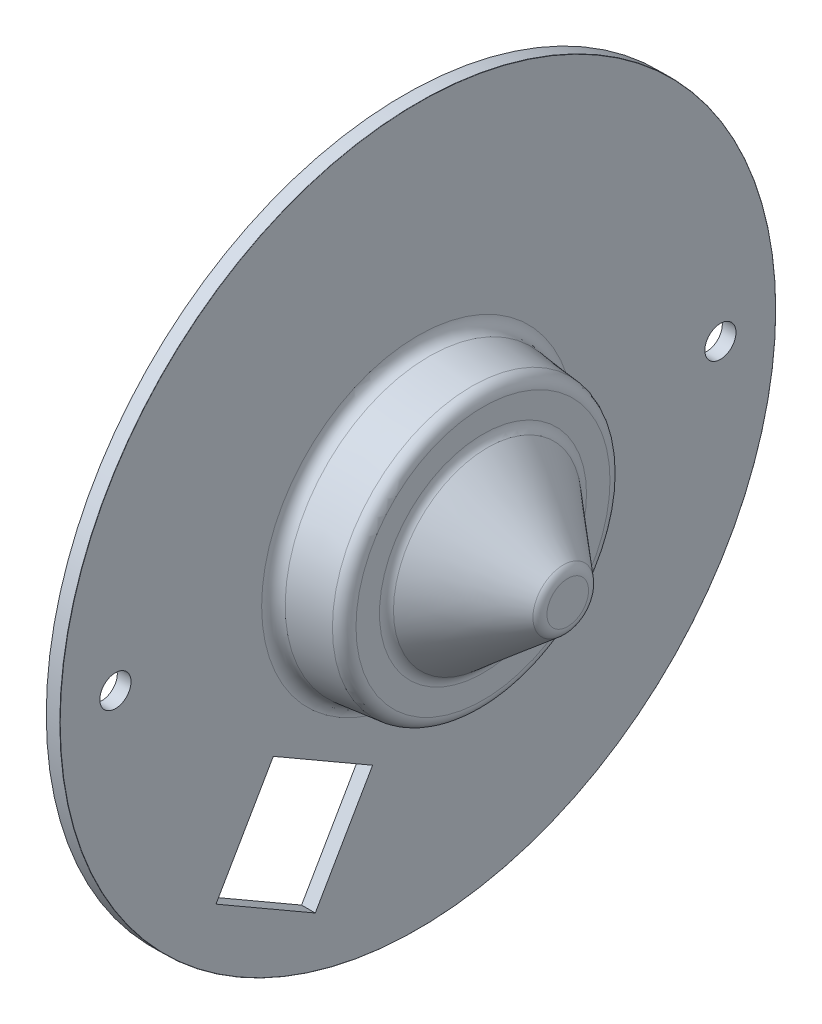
ISO-10303-21;
HEADER;
FILE_DESCRIPTION(('STEP AP214'),'2;1');
FILE_NAME('part.step','',(''),(''),'','','');
FILE_SCHEMA(('AUTOMOTIVE_DESIGN { 1 0 10303 214 1 1 1 1 }'));
ENDSEC;
DATA;
#1=APPLICATION_CONTEXT('core data for automotive mechanical design processes');
#2=APPLICATION_PROTOCOL_DEFINITION('international standard','automotive_design',2000,#1);
#3=PRODUCT_CONTEXT('',#1,'mechanical');
#4=PRODUCT('Part','Part','',(#3));
#5=PRODUCT_RELATED_PRODUCT_CATEGORY('part','',(#4));
#6=PRODUCT_DEFINITION_FORMATION('','',#4);
#7=PRODUCT_DEFINITION_CONTEXT('part definition',#1,'design');
#8=PRODUCT_DEFINITION('design','',#6,#7);
#9=PRODUCT_DEFINITION_SHAPE('','',#8);
#10=(LENGTH_UNIT() NAMED_UNIT(*) SI_UNIT(.MILLI.,.METRE.));
#11=(NAMED_UNIT(*) PLANE_ANGLE_UNIT() SI_UNIT($,.RADIAN.));
#12=(NAMED_UNIT(*) SI_UNIT($,.STERADIAN.) SOLID_ANGLE_UNIT());
#13=UNCERTAINTY_MEASURE_WITH_UNIT(LENGTH_MEASURE(1.E-05),#10,'distance_accuracy_value','');
#14=(GEOMETRIC_REPRESENTATION_CONTEXT(3) GLOBAL_UNCERTAINTY_ASSIGNED_CONTEXT((#13)) GLOBAL_UNIT_ASSIGNED_CONTEXT((#10,
#11,#12)) REPRESENTATION_CONTEXT('',''));
#15=CARTESIAN_POINT('',(0.,0.,0.));
#16=DIRECTION('',(0.,0.,1.));
#17=DIRECTION('',(1.,0.,0.));
#18=AXIS2_PLACEMENT_3D('',#15,#16,#17);
#19=CARTESIAN_POINT('',(16.6624,0.,0.));
#20=DIRECTION('',(1.,0.,0.));
#21=DIRECTION('',(0.,0.,-1.));
#22=AXIS2_PLACEMENT_3D('',#19,#20,#21);
#23=PLANE('',#22);
#24=CARTESIAN_POINT('',(16.6624,0.,0.));
#25=DIRECTION('',(-1.,0.,0.));
#26=DIRECTION('',(0.,0.,-1.));
#27=AXIS2_PLACEMENT_3D('',#24,#25,#26);
#28=CIRCLE('',#27,2.1181248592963);
#29=CARTESIAN_POINT('',(16.6624,0.,-2.1181248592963));
#30=VERTEX_POINT('',#29);
#31=EDGE_CURVE('E209',#30,#30,#28,.T.);
#32=ORIENTED_EDGE('',*,*,#31,.F.);
#33=EDGE_LOOP('',(#32));
#34=FACE_BOUND('',#33,.T.);
#35=ADVANCED_FACE('F17',(#34),#23,.T.);
#36=CARTESIAN_POINT('',(15.3924,0.,0.));
#37=DIRECTION('',(-1.,0.,0.));
#38=DIRECTION('',(0.,1.,0.));
#39=AXIS2_PLACEMENT_3D('',#36,#37,#38);
#40=TOROIDAL_SURFACE('',#39,2.1181248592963,1.27);
#41=CARTESIAN_POINT('',(16.2087402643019,0.,0.));
#42=DIRECTION('',(-1.,0.,0.));
#43=DIRECTION('',(0.,0.,-1.));
#44=AXIS2_PLACEMENT_3D('',#41,#42,#43);
#45=CIRCLE('',#44,3.09100130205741);
#46=CARTESIAN_POINT('',(16.2087402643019,0.,3.09100130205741));
#47=VERTEX_POINT('',#46);
#48=EDGE_CURVE('E201',#47,#47,#45,.T.);
#49=ORIENTED_EDGE('',*,*,#48,.F.);
#50=EDGE_LOOP('',(#49));
#51=FACE_BOUND('',#50,.T.);
#52=ORIENTED_EDGE('',*,*,#31,.T.);
#53=EDGE_LOOP('',(#52));
#54=FACE_BOUND('',#53,.T.);
#55=ADVANCED_FACE('F216',(#51,#54),#40,.T.);
#56=CARTESIAN_POINT('',(8.4800597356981,0.,0.));
#57=DIRECTION('',(-1.,0.,0.));
#58=DIRECTION('',(0.,0.,1.));
#59=AXIS2_PLACEMENT_3D('',#56,#57,#58);
#60=CONICAL_SURFACE('',#59,9.57613428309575,0.698131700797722);
#61=CARTESIAN_POINT('',(8.48005973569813,0.,0.));
#62=DIRECTION('',(-1.,0.,0.));
#63=DIRECTION('',(0.,1.,0.));
#64=AXIS2_PLACEMENT_3D('',#61,#62,#63);
#65=CIRCLE('',#64,9.57613428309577);
#66=CARTESIAN_POINT('',(8.48005973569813,0.,9.57613428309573));
#67=VERTEX_POINT('',#66);
#68=EDGE_CURVE('E187',#67,#67,#65,.F.);
#69=CARTESIAN_POINT('',(16.2087402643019,0.,3.09100130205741));
#70=CARTESIAN_POINT('',(16.1282331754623,0.,3.15855477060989));
#71=CARTESIAN_POINT('',(16.0477260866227,0.,3.22610823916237));
#72=CARTESIAN_POINT('',(15.8867119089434,0.,3.36121517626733));
#73=CARTESIAN_POINT('',(15.8062048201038,0.,3.42876864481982));
#74=CARTESIAN_POINT('',(15.6451906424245,0.,3.56387558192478));
#75=CARTESIAN_POINT('',(15.5646835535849,0.,3.63142905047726));
#76=CARTESIAN_POINT('',(15.4036693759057,0.,3.76653598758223));
#77=CARTESIAN_POINT('',(15.3231622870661,0.,3.83408945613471));
#78=CARTESIAN_POINT('',(15.1621481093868,0.,3.96919639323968));
#79=CARTESIAN_POINT('',(15.0816410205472,0.,4.03674986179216));
#80=CARTESIAN_POINT('',(14.9206268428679,0.,4.17185679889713));
#81=CARTESIAN_POINT('',(14.8401197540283,0.,4.23941026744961));
#82=CARTESIAN_POINT('',(14.6791055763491,0.,4.37451720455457));
#83=CARTESIAN_POINT('',(14.5985984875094,0.,4.44207067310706));
#84=CARTESIAN_POINT('',(14.4375843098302,0.,4.57717761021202));
#85=CARTESIAN_POINT('',(14.3570772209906,0.,4.6447310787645));
#86=CARTESIAN_POINT('',(14.1960630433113,0.,4.77983801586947));
#87=CARTESIAN_POINT('',(14.1155559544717,0.,4.84739148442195));
#88=CARTESIAN_POINT('',(13.9545417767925,0.,4.98249842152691));
#89=CARTESIAN_POINT('',(13.8740346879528,0.,5.0500518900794));
#90=CARTESIAN_POINT('',(13.7130205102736,0.,5.18515882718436));
#91=CARTESIAN_POINT('',(13.632513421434,0.,5.25271229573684));
#92=CARTESIAN_POINT('',(13.4714992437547,0.,5.38781923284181));
#93=CARTESIAN_POINT('',(13.3909921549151,0.,5.45537270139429));
#94=CARTESIAN_POINT('',(13.2299779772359,0.,5.59047963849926));
#95=CARTESIAN_POINT('',(13.1494708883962,0.,5.65803310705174));
#96=CARTESIAN_POINT('',(12.988456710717,0.,5.79314004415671));
#97=CARTESIAN_POINT('',(12.9079496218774,0.,5.86069351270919));
#98=CARTESIAN_POINT('',(12.7469354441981,0.,5.99580044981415));
#99=CARTESIAN_POINT('',(12.6664283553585,0.,6.06335391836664));
#100=CARTESIAN_POINT('',(12.5054141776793,0.,6.1984608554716));
#101=CARTESIAN_POINT('',(12.4249070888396,0.,6.26601432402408));
#102=CARTESIAN_POINT('',(12.2638929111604,0.,6.40112126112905));
#103=CARTESIAN_POINT('',(12.1833858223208,0.,6.46867472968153));
#104=CARTESIAN_POINT('',(12.0223716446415,0.,6.60378166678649));
#105=CARTESIAN_POINT('',(11.9418645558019,0.,6.67133513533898));
#106=CARTESIAN_POINT('',(11.7808503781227,0.,6.80644207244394));
#107=CARTESIAN_POINT('',(11.700343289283,0.,6.87399554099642));
#108=CARTESIAN_POINT('',(11.5393291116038,0.,7.00910247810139));
#109=CARTESIAN_POINT('',(11.4588220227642,0.,7.07665594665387));
#110=CARTESIAN_POINT('',(11.2978078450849,0.,7.21176288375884));
#111=CARTESIAN_POINT('',(11.2173007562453,0.,7.27931635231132));
#112=CARTESIAN_POINT('',(11.0562865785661,0.,7.41442328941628));
#113=CARTESIAN_POINT('',(10.9757794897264,0.,7.48197675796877));
#114=CARTESIAN_POINT('',(10.8147653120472,0.,7.61708369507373));
#115=CARTESIAN_POINT('',(10.7342582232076,0.,7.68463716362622));
#116=CARTESIAN_POINT('',(10.5732440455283,0.,7.81974410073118));
#117=CARTESIAN_POINT('',(10.4927369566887,0.,7.88729756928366));
#118=CARTESIAN_POINT('',(10.3317227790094,0.,8.02240450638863));
#119=CARTESIAN_POINT('',(10.2512156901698,0.,8.08995797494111));
#120=CARTESIAN_POINT('',(10.0902015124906,0.,8.22506491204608));
#121=CARTESIAN_POINT('',(10.009694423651,0.,8.29261838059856));
#122=CARTESIAN_POINT('',(9.84868024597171,0.,8.42772531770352));
#123=CARTESIAN_POINT('',(9.76817315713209,0.,8.49527878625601));
#124=CARTESIAN_POINT('',(9.60715897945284,0.,8.63038572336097));
#125=CARTESIAN_POINT('',(9.52665189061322,0.,8.69793919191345));
#126=CARTESIAN_POINT('',(9.36563771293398,0.,8.83304612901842));
#127=CARTESIAN_POINT('',(9.28513062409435,0.,8.9005995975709));
#128=CARTESIAN_POINT('',(9.12411644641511,0.,9.03570653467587));
#129=CARTESIAN_POINT('',(9.04360935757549,0.,9.10326000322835));
#130=CARTESIAN_POINT('',(8.88259517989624,0.,9.23836694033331));
#131=CARTESIAN_POINT('',(8.80208809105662,0.,9.30592040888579));
#132=CARTESIAN_POINT('',(8.64107391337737,0.,9.44102734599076));
#133=CARTESIAN_POINT('',(8.56056682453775,0.,9.50858081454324));
#134=CARTESIAN_POINT('',(8.48005973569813,0.,9.57613428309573));
#135=B_SPLINE_CURVE_WITH_KNOTS('',3,(#69,#70,#71,#72,#73,#74,#75,#76,#77,#78,#79,#80,#81,#82,
#83,#84,#85,#86,#87,#88,#89,#90,#91,#92,#93,#94,#95,#96,#97,#98,#99,#100,#101,#102,#103,#104,
#105,#106,#107,#108,#109,#110,#111,#112,#113,#114,#115,#116,#117,#118,#119,#120,#121,#122,#123,
#124,#125,#126,#127,#128,#129,#130,#131,#132,#133,#134),.UNSPECIFIED.,.F.,.F.,(4,2,2,2,2,2,2,2,
2,2,2,2,2,2,2,2,2,2,2,2,2,2,2,2,2,2,2,2,2,2,2,2,4),(0.,0.315283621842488,0.630567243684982,
0.945850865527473,1.26113448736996,1.57641810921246,1.89170173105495,2.20698535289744,
2.52226897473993,2.83755259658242,3.15283621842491,3.46811984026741,3.7834034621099,
4.09868708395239,4.41397070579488,4.72925432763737,5.04453794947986,5.35982157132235,
5.67510519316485,5.99038881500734,6.30567243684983,6.62095605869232,6.93623968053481,
7.2515233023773,7.56680692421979,7.88209054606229,8.19737416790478,8.51265778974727,
8.82794141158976,9.14322503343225,9.45850865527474,9.77379227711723,10.0890758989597),.UNSPECIFIED.);
#136=EDGE_CURVE('BSEAM193',#47,#67,#135,.T.);
#137=ORIENTED_EDGE('',*,*,#48,.T.);
#138=ORIENTED_EDGE('',*,*,#68,.T.);
#139=ORIENTED_EDGE('',*,*,#136,.T.);
#140=ORIENTED_EDGE('',*,*,#136,.F.);
#141=EDGE_LOOP('',(#137,#139,#138,#140));
#142=FACE_BOUND('',#141,.T.);
#143=ADVANCED_FACE('F193',(#142),#60,.T.);
#144=CARTESIAN_POINT('',(9.2964,0.,0.));
#145=DIRECTION('',(-1.,0.,0.));
#146=DIRECTION('',(0.,1.,0.));
#147=AXIS2_PLACEMENT_3D('',#144,#145,#146);
#148=TOROIDAL_SURFACE('',#147,10.5490107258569,1.27);
#149=CARTESIAN_POINT('',(8.0264,0.,0.));
#150=DIRECTION('',(1.,0.,0.));
#151=DIRECTION('',(0.,0.,-1.));
#152=AXIS2_PLACEMENT_3D('',#149,#150,#151);
#153=CIRCLE('',#152,10.5490107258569);
#154=CARTESIAN_POINT('',(8.0264,0.,-10.5490107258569));
#155=VERTEX_POINT('',#154);
#156=EDGE_CURVE('E443',#155,#155,#153,.F.);
#157=ORIENTED_EDGE('',*,*,#156,.F.);
#158=EDGE_LOOP('',(#157));
#159=FACE_BOUND('',#158,.T.);
#160=ORIENTED_EDGE('',*,*,#68,.F.);
#161=EDGE_LOOP('',(#160));
#162=FACE_BOUND('',#161,.T.);
#163=ADVANCED_FACE('F189',(#159,#162),#148,.F.);
#164=CARTESIAN_POINT('',(8.0264,0.,0.));
#165=DIRECTION('',(1.,0.,0.));
#166=DIRECTION('',(0.,0.,-1.));
#167=AXIS2_PLACEMENT_3D('',#164,#165,#166);
#168=PLANE('',#167);
#169=ORIENTED_EDGE('',*,*,#156,.T.);
#170=EDGE_LOOP('',(#169));
#171=FACE_BOUND('',#170,.T.);
#172=CARTESIAN_POINT('',(8.0264,0.,0.));
#173=DIRECTION('',(-1.,0.,0.));
#174=DIRECTION('',(0.,0.,-1.));
#175=AXIS2_PLACEMENT_3D('',#172,#173,#174);
#176=CIRCLE('',#175,12.9425088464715);
#177=CARTESIAN_POINT('',(8.0264,0.,-12.9425088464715));
#178=VERTEX_POINT('',#177);
#179=EDGE_CURVE('E155',#178,#178,#176,.T.);
#180=ORIENTED_EDGE('',*,*,#179,.F.);
#181=EDGE_LOOP('',(#180));
#182=FACE_BOUND('',#181,.T.);
#183=ADVANCED_FACE('F169',(#171,#182),#168,.T.);
#184=CARTESIAN_POINT('',(6.7564,0.,0.));
#185=DIRECTION('',(-1.,0.,0.));
#186=DIRECTION('',(0.,1.,0.));
#187=AXIS2_PLACEMENT_3D('',#184,#185,#186);
#188=TOROIDAL_SURFACE('',#187,12.9425088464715,1.27);
#189=CARTESIAN_POINT('',(6.88915114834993,0.,0.));
#190=DIRECTION('',(-1.,0.,0.));
#191=DIRECTION('',(0.,0.,-1.));
#192=AXIS2_PLACEMENT_3D('',#189,#190,#191);
#193=CIRCLE('',#192,14.2055516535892);
#194=CARTESIAN_POINT('',(6.88915114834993,0.,-14.2055516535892));
#195=VERTEX_POINT('',#194);
#196=EDGE_CURVE('E147',#195,#195,#193,.T.);
#197=ORIENTED_EDGE('',*,*,#196,.F.);
#198=EDGE_LOOP('',(#197));
#199=FACE_BOUND('',#198,.T.);
#200=ORIENTED_EDGE('',*,*,#179,.T.);
#201=EDGE_LOOP('',(#200));
#202=FACE_BOUND('',#201,.T.);
#203=ADVANCED_FACE('F163',(#199,#202),#188,.T.);
#204=CARTESIAN_POINT('',(15.2654,0.,0.));
#205=DIRECTION('',(1.,0.,0.));
#206=DIRECTION('',(0.,0.,-1.));
#207=AXIS2_PLACEMENT_3D('',#204,#205,#206);
#208=PLANE('',#207);
#209=CARTESIAN_POINT('',(15.2654,0.,0.));
#210=DIRECTION('',(-1.,0.,0.));
#211=DIRECTION('',(0.,0.,1.));
#212=AXIS2_PLACEMENT_3D('',#209,#210,#211);
#213=CIRCLE('',#212,2.05890378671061);
#214=CARTESIAN_POINT('',(15.2654,0.,2.05890378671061));
#215=VERTEX_POINT('',#214);
#216=EDGE_CURVE('E21',#215,#215,#213,.T.);
#217=ORIENTED_EDGE('',*,*,#216,.T.);
#218=EDGE_LOOP('',(#217));
#219=FACE_BOUND('',#218,.T.);
#220=ADVANCED_FACE('F168',(#219),#208,.F.);
#221=CARTESIAN_POINT('',(2.53424885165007,0.,0.));
#222=DIRECTION('',(-1.,0.,0.));
#223=DIRECTION('',(0.,0.,1.));
#224=AXIS2_PLACEMENT_3D('',#221,#222,#223);
#225=CONICAL_SURFACE('',#224,14.6632703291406,0.10471975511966);
#226=CARTESIAN_POINT('',(2.53424885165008,0.,0.));
#227=DIRECTION('',(-1.,0.,0.));
#228=DIRECTION('',(0.,1.,0.));
#229=AXIS2_PLACEMENT_3D('',#226,#227,#228);
#230=CIRCLE('',#229,14.6632703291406);
#231=CARTESIAN_POINT('',(2.53424885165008,14.6632703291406,0.));
#232=VERTEX_POINT('',#231);
#233=EDGE_CURVE('E128',#232,#232,#230,.F.);
#234=ORIENTED_EDGE('',*,*,#233,.T.);
#235=EDGE_LOOP('',(#234));
#236=FACE_BOUND('',#235,.T.);
#237=ORIENTED_EDGE('',*,*,#196,.T.);
#238=EDGE_LOOP('',(#237));
#239=FACE_BOUND('',#238,.T.);
#240=ADVANCED_FACE('F373',(#236,#239),#225,.T.);
#241=CARTESIAN_POINT('',(7.58208544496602,0.,0.));
#242=DIRECTION('',(-1.,0.,0.));
#243=DIRECTION('',(0.,0.,1.));
#244=AXIS2_PLACEMENT_3D('',#241,#242,#243);
#245=CONICAL_SURFACE('',#244,8.50597019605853,0.698131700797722);
#246=CARTESIAN_POINT('',(7.58208544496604,0.,0.));
#247=DIRECTION('',(-1.,0.,0.));
#248=DIRECTION('',(0.,1.,0.));
#249=AXIS2_PLACEMENT_3D('',#246,#247,#248);
#250=CIRCLE('',#249,8.50597019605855);
#251=CARTESIAN_POINT('',(7.58208544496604,0.,8.50597019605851));
#252=VERTEX_POINT('',#251);
#253=EDGE_CURVE('E256',#252,#252,#250,.F.);
#254=CARTESIAN_POINT('',(15.2654,0.,2.05890378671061));
#255=CARTESIAN_POINT('',(15.1853654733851,0.,2.12606072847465));
#256=CARTESIAN_POINT('',(15.1053309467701,0.,2.19321767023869));
#257=CARTESIAN_POINT('',(14.9452618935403,0.,2.32753155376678));
#258=CARTESIAN_POINT('',(14.8652273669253,0.,2.39468849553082));
#259=CARTESIAN_POINT('',(14.7051583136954,0.,2.5290023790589));
#260=CARTESIAN_POINT('',(14.6251237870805,0.,2.59615932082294));
#261=CARTESIAN_POINT('',(14.4650547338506,0.,2.73047320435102));
#262=CARTESIAN_POINT('',(14.3850202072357,0.,2.79763014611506));
#263=CARTESIAN_POINT('',(14.2249511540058,0.,2.93194402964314));
#264=CARTESIAN_POINT('',(14.1449166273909,0.,2.99910097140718));
#265=CARTESIAN_POINT('',(13.984847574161,0.,3.13341485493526));
#266=CARTESIAN_POINT('',(13.9048130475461,0.,3.2005717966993));
#267=CARTESIAN_POINT('',(13.7447439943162,0.,3.33488568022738));
#268=CARTESIAN_POINT('',(13.6647094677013,0.,3.40204262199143));
#269=CARTESIAN_POINT('',(13.5046404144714,0.,3.53635650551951));
#270=CARTESIAN_POINT('',(13.4246058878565,0.,3.60351344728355));
#271=CARTESIAN_POINT('',(13.2645368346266,0.,3.73782733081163));
#272=CARTESIAN_POINT('',(13.1845023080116,0.,3.80498427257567));
#273=CARTESIAN_POINT('',(13.0244332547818,0.,3.93929815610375));
#274=CARTESIAN_POINT('',(12.9443987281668,0.,4.00645509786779));
#275=CARTESIAN_POINT('',(12.784329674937,0.,4.14076898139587));
#276=CARTESIAN_POINT('',(12.704295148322,0.,4.20792592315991));
#277=CARTESIAN_POINT('',(12.5442260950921,0.,4.34223980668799));
#278=CARTESIAN_POINT('',(12.4641915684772,0.,4.40939674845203));
#279=CARTESIAN_POINT('',(12.3041225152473,0.,4.54371063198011));
#280=CARTESIAN_POINT('',(12.2240879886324,0.,4.61086757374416));
#281=CARTESIAN_POINT('',(12.0640189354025,0.,4.74518145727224));
#282=CARTESIAN_POINT('',(11.9839844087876,0.,4.81233839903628));
#283=CARTESIAN_POINT('',(11.8239153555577,0.,4.94665228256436));
#284=CARTESIAN_POINT('',(11.7438808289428,0.,5.0138092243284));
#285=CARTESIAN_POINT('',(11.5838117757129,0.,5.14812310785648));
#286=CARTESIAN_POINT('',(11.503777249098,0.,5.21528004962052));
#287=CARTESIAN_POINT('',(11.3437081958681,0.,5.3495939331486));
#288=CARTESIAN_POINT('',(11.2636736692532,0.,5.41675087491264));
#289=CARTESIAN_POINT('',(11.1036046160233,0.,5.55106475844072));
#290=CARTESIAN_POINT('',(11.0235700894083,0.,5.61822170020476));
#291=CARTESIAN_POINT('',(10.8635010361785,0.,5.75253558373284));
#292=CARTESIAN_POINT('',(10.7834665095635,0.,5.81969252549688));
#293=CARTESIAN_POINT('',(10.6233974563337,0.,5.95400640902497));
#294=CARTESIAN_POINT('',(10.5433629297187,0.,6.02116335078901));
#295=CARTESIAN_POINT('',(10.3832938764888,0.,6.15547723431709));
#296=CARTESIAN_POINT('',(10.3032593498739,0.,6.22263417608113));
#297=CARTESIAN_POINT('',(10.143190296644,0.,6.35694805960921));
#298=CARTESIAN_POINT('',(10.0631557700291,0.,6.42410500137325));
#299=CARTESIAN_POINT('',(9.90308671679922,0.,6.55841888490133));
#300=CARTESIAN_POINT('',(9.82305219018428,0.,6.62557582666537));
#301=CARTESIAN_POINT('',(9.66298313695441,0.,6.75988971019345));
#302=CARTESIAN_POINT('',(9.58294861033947,0.,6.82704665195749));
#303=CARTESIAN_POINT('',(9.4228795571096,0.,6.96136053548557));
#304=CARTESIAN_POINT('',(9.34284503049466,0.,7.02851747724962));
#305=CARTESIAN_POINT('',(9.18277597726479,0.,7.1628313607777));
#306=CARTESIAN_POINT('',(9.10274145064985,0.,7.22998830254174));
#307=CARTESIAN_POINT('',(8.94267239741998,0.,7.36430218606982));
#308=CARTESIAN_POINT('',(8.86263787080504,0.,7.43145912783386));
#309=CARTESIAN_POINT('',(8.70256881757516,0.,7.56577301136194));
#310=CARTESIAN_POINT('',(8.62253429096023,0.,7.63292995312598));
#311=CARTESIAN_POINT('',(8.46246523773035,0.,7.76724383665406));
#312=CARTESIAN_POINT('',(8.38243071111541,0.,7.8344007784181));
#313=CARTESIAN_POINT('',(8.22236165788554,0.,7.96871466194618));
#314=CARTESIAN_POINT('',(8.1423271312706,0.,8.03587160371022));
#315=CARTESIAN_POINT('',(7.98225807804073,0.,8.1701854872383));
#316=CARTESIAN_POINT('',(7.90222355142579,0.,8.23734242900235));
#317=CARTESIAN_POINT('',(7.74215449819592,0.,8.37165631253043));
#318=CARTESIAN_POINT('',(7.66211997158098,0.,8.43881325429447));
#319=CARTESIAN_POINT('',(7.58208544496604,0.,8.50597019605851));
#320=B_SPLINE_CURVE_WITH_KNOTS('',3,(#254,#255,#256,#257,#258,#259,#260,#261,#262,#263,#264,
#265,#266,#267,#268,#269,#270,#271,#272,#273,#274,#275,#276,#277,#278,#279,#280,#281,#282,#283,
#284,#285,#286,#287,#288,#289,#290,#291,#292,#293,#294,#295,#296,#297,#298,#299,#300,#301,#302,
#303,#304,#305,#306,#307,#308,#309,#310,#311,#312,#313,#314,#315,#316,#317,#318,#319),
.UNSPECIFIED.,.F.,.F.,(4,2,2,2,2,2,2,2,2,2,2,2,2,2,2,2,2,2,2,2,2,2,2,2,2,2,2,2,2,2,2,2,4),(0.,
0.313432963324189,0.626865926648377,0.940298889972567,1.25373185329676,1.56716481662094,
1.88059777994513,2.19403074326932,2.50746370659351,2.8208966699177,3.13432963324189,
3.44776259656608,3.76119555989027,4.07462852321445,4.38806148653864,4.70149444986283,
5.01492741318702,5.32836037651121,5.6417933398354,5.95522630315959,6.26865926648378,
6.58209222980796,6.89552519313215,7.20895815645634,7.52239111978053,7.83582408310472,
8.14925704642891,8.4626900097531,8.77612297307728,9.08955593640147,9.40298889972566,
9.71642186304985,10.029854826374),.UNSPECIFIED.);
#321=EDGE_CURVE('BSEAM136',#215,#252,#320,.T.);
#322=ORIENTED_EDGE('',*,*,#216,.F.);
#323=ORIENTED_EDGE('',*,*,#253,.F.);
#324=ORIENTED_EDGE('',*,*,#321,.T.);
#325=ORIENTED_EDGE('',*,*,#321,.F.);
#326=EDGE_LOOP('',(#322,#324,#323,#325));
#327=FACE_BOUND('',#326,.T.);
#328=ADVANCED_FACE('F136',(#327),#245,.F.);
#329=CARTESIAN_POINT('',(2.667,0.,0.));
#330=DIRECTION('',(-1.,0.,0.));
#331=DIRECTION('',(0.,1.,0.));
#332=AXIS2_PLACEMENT_3D('',#329,#330,#331);
#333=TOROIDAL_SURFACE('',#332,15.9263131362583,1.27);
#334=CARTESIAN_POINT('',(1.397,0.,0.));
#335=DIRECTION('',(1.,0.,0.));
#336=DIRECTION('',(0.,0.,-1.));
#337=AXIS2_PLACEMENT_3D('',#334,#335,#336);
#338=CIRCLE('',#337,15.9263131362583);
#339=CARTESIAN_POINT('',(1.397,0.,-15.9263131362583));
#340=VERTEX_POINT('',#339);
#341=EDGE_CURVE('E252',#340,#340,#338,.F.);
#342=ORIENTED_EDGE('',*,*,#341,.F.);
#343=EDGE_LOOP('',(#342));
#344=FACE_BOUND('',#343,.T.);
#345=ORIENTED_EDGE('',*,*,#233,.F.);
#346=EDGE_LOOP('',(#345));
#347=FACE_BOUND('',#346,.T.);
#348=ADVANCED_FACE('F131',(#344,#347),#333,.F.);
#349=CARTESIAN_POINT('',(9.2964,0.,0.));
#350=DIRECTION('',(-1.,0.,0.));
#351=DIRECTION('',(0.,1.,0.));
#352=AXIS2_PLACEMENT_3D('',#349,#350,#351);
#353=TOROIDAL_SURFACE('',#352,10.5490107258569,2.667);
#354=CARTESIAN_POINT('',(6.6294,0.,0.));
#355=DIRECTION('',(-1.,0.,0.));
#356=DIRECTION('',(0.,0.,-1.));
#357=AXIS2_PLACEMENT_3D('',#354,#355,#356);
#358=CIRCLE('',#357,10.5490107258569);
#359=CARTESIAN_POINT('',(6.6294,0.,-10.5490107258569));
#360=VERTEX_POINT('',#359);
#361=EDGE_CURVE('E88',#360,#360,#358,.T.);
#362=ORIENTED_EDGE('',*,*,#361,.T.);
#363=EDGE_LOOP('',(#362));
#364=FACE_BOUND('',#363,.T.);
#365=ORIENTED_EDGE('',*,*,#253,.T.);
#366=EDGE_LOOP('',(#365));
#367=FACE_BOUND('',#366,.T.);
#368=ADVANCED_FACE('F135',(#364,#367),#353,.T.);
#369=CARTESIAN_POINT('',(1.397,0.,0.));
#370=DIRECTION('',(1.,0.,0.));
#371=DIRECTION('',(0.,0.,-1.));
#372=AXIS2_PLACEMENT_3D('',#369,#370,#371);
#373=PLANE('',#372);
#374=CARTESIAN_POINT('',(1.397,0.,0.));
#375=DIRECTION('',(-1.,0.,0.));
#376=DIRECTION('',(0.,0.,-1.));
#377=AXIS2_PLACEMENT_3D('',#374,#375,#376);
#378=CIRCLE('',#377,36.449);
#379=CARTESIAN_POINT('',(1.397,0.,-36.449));
#380=VERTEX_POINT('',#379);
#381=EDGE_CURVE('E249',#380,#380,#378,.T.);
#382=ORIENTED_EDGE('',*,*,#381,.F.);
#383=EDGE_LOOP('',(#382));
#384=FACE_BOUND('',#383,.T.);
#385=CARTESIAN_POINT('',(1.397,0.,-30.8229));
#386=DIRECTION('',(1.,0.,0.));
#387=DIRECTION('',(0.,0.,-1.));
#388=AXIS2_PLACEMENT_3D('',#385,#386,#387);
#389=CIRCLE('',#388,1.5875);
#390=CARTESIAN_POINT('',(1.397,0.,-32.4104));
#391=VERTEX_POINT('',#390);
#392=EDGE_CURVE('E69',#391,#391,#389,.F.);
#393=ORIENTED_EDGE('',*,*,#392,.T.);
#394=EDGE_LOOP('',(#393));
#395=FACE_BOUND('',#394,.T.);
#396=DIRECTION('',(0.,-0.499999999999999,-0.866025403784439));
#397=VECTOR('',#396,1.);
#398=CARTESIAN_POINT('',(1.397,-26.8803893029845,15.5194));
#399=LINE('',#398,#397);
#400=CARTESIAN_POINT('',(1.397,-29.8013893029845,10.4600795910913));
#401=VERTEX_POINT('',#400);
#402=CARTESIAN_POINT('',(1.397,-23.9593893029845,20.5787204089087));
#403=VERTEX_POINT('',#402);
#404=EDGE_CURVE('E57',#401,#403,#399,.F.);
#405=ORIENTED_EDGE('',*,*,#404,.T.);
#406=DIRECTION('',(0.,-0.86602540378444,0.499999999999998));
#407=VECTOR('',#406,1.);
#408=CARTESIAN_POINT('',(1.397,-18.9000688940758,17.6577204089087));
#409=LINE('',#408,#407);
#410=CARTESIAN_POINT('',(1.397,-13.8407484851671,14.7367204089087));
#411=VERTEX_POINT('',#410);
#412=EDGE_CURVE('E520',#403,#411,#409,.F.);
#413=ORIENTED_EDGE('',*,*,#412,.T.);
#414=DIRECTION('',(0.,0.499999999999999,0.866025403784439));
#415=VECTOR('',#414,1.);
#416=CARTESIAN_POINT('',(1.397,-16.7617484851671,9.67739999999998));
#417=LINE('',#416,#415);
#418=CARTESIAN_POINT('',(1.397,-19.6827484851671,4.61807959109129));
#419=VERTEX_POINT('',#418);
#420=EDGE_CURVE('E63',#411,#419,#417,.F.);
#421=ORIENTED_EDGE('',*,*,#420,.T.);
#422=DIRECTION('',(0.,0.86602540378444,-0.499999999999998));
#423=VECTOR('',#422,1.);
#424=CARTESIAN_POINT('',(1.397,-24.7420688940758,7.53907959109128));
#425=LINE('',#424,#423);
#426=EDGE_CURVE('E60',#419,#401,#425,.F.);
#427=ORIENTED_EDGE('',*,*,#426,.T.);
#428=EDGE_LOOP('',(#405,#413,#421,#427));
#429=FACE_BOUND('',#428,.T.);
#430=CARTESIAN_POINT('',(1.397,0.,30.8229));
#431=DIRECTION('',(1.,0.,0.));
#432=DIRECTION('',(0.,0.,-1.));
#433=AXIS2_PLACEMENT_3D('',#430,#431,#432);
#434=CIRCLE('',#433,1.5875);
#435=CARTESIAN_POINT('',(1.397,0.,29.2354));
#436=VERTEX_POINT('',#435);
#437=EDGE_CURVE('E244',#436,#436,#434,.F.);
#438=ORIENTED_EDGE('',*,*,#437,.T.);
#439=EDGE_LOOP('',(#438));
#440=FACE_BOUND('',#439,.T.);
#441=ORIENTED_EDGE('',*,*,#341,.T.);
#442=EDGE_LOOP('',(#441));
#443=FACE_BOUND('',#442,.T.);
#444=ADVANCED_FACE('F61',(#384,#395,#429,#440,#443),#373,.T.);
#445=CARTESIAN_POINT('',(1.3716,0.,0.));
#446=DIRECTION('',(-1.,0.,0.));
#447=DIRECTION('',(0.,1.,0.));
#448=AXIS2_PLACEMENT_3D('',#445,#446,#447);
#449=TOROIDAL_SURFACE('',#448,36.449,0.0254);
#450=CARTESIAN_POINT('',(1.3716,0.,0.));
#451=DIRECTION('',(1.,0.,0.));
#452=DIRECTION('',(0.,0.,-1.));
#453=AXIS2_PLACEMENT_3D('',#450,#451,#452);
#454=CIRCLE('',#453,36.4744);
#455=CARTESIAN_POINT('',(1.3716,0.,-36.4744));
#456=VERTEX_POINT('',#455);
#457=EDGE_CURVE('E243',#456,#456,#454,.F.);
#458=ORIENTED_EDGE('',*,*,#457,.F.);
#459=EDGE_LOOP('',(#458));
#460=FACE_BOUND('',#459,.T.);
#461=ORIENTED_EDGE('',*,*,#381,.T.);
#462=EDGE_LOOP('',(#461));
#463=FACE_BOUND('',#462,.T.);
#464=ADVANCED_FACE('F106',(#460,#463),#449,.T.);
#465=CARTESIAN_POINT('',(6.6294,0.,0.));
#466=DIRECTION('',(1.,0.,0.));
#467=DIRECTION('',(0.,0.,-1.));
#468=AXIS2_PLACEMENT_3D('',#465,#466,#467);
#469=PLANE('',#468);
#470=ORIENTED_EDGE('',*,*,#361,.F.);
#471=EDGE_LOOP('',(#470));
#472=FACE_BOUND('',#471,.T.);
#473=CARTESIAN_POINT('',(6.62939999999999,0.,0.));
#474=DIRECTION('',(-1.,0.,0.));
#475=DIRECTION('',(0.,0.,1.));
#476=AXIS2_PLACEMENT_3D('',#473,#474,#475);
#477=CIRCLE('',#476,12.8281575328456);
#478=CARTESIAN_POINT('',(6.62939999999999,0.,12.8281575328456));
#479=VERTEX_POINT('',#478);
#480=EDGE_CURVE('E240',#479,#479,#477,.T.);
#481=ORIENTED_EDGE('',*,*,#480,.T.);
#482=EDGE_LOOP('',(#481));
#483=FACE_BOUND('',#482,.T.);
#484=ADVANCED_FACE('F95',(#472,#483),#469,.F.);
#485=CARTESIAN_POINT('',(-103.105107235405,0.,-30.8229));
#486=DIRECTION('',(1.,0.,0.));
#487=DIRECTION('',(0.,0.,-1.));
#488=AXIS2_PLACEMENT_3D('',#485,#486,#487);
#489=CYLINDRICAL_SURFACE('',#488,1.5875);
#490=ORIENTED_EDGE('',*,*,#392,.F.);
#491=EDGE_LOOP('',(#490));
#492=FACE_BOUND('',#491,.T.);
#493=CARTESIAN_POINT('',(0.,0.,-30.8229));
#494=DIRECTION('',(1.,0.,0.));
#495=DIRECTION('',(0.,0.,-1.));
#496=AXIS2_PLACEMENT_3D('',#493,#494,#495);
#497=CIRCLE('',#496,1.5875);
#498=CARTESIAN_POINT('',(0.,0.,-32.4104));
#499=VERTEX_POINT('',#498);
#500=EDGE_CURVE('E237',#499,#499,#497,.F.);
#501=ORIENTED_EDGE('',*,*,#500,.T.);
#502=EDGE_LOOP('',(#501));
#503=FACE_BOUND('',#502,.T.);
#504=ADVANCED_FACE('F105',(#492,#503),#489,.F.);
#505=CARTESIAN_POINT('',(-103.105107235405,-24.7420688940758,7.53907959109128));
#506=DIRECTION('',(0.,-0.499999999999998,-0.86602540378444));
#507=DIRECTION('',(0.,0.86602540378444,-0.499999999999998));
#508=AXIS2_PLACEMENT_3D('',#505,#506,#507);
#509=PLANE('',#508);
#510=DIRECTION('',(1.,0.,0.));
#511=VECTOR('',#510,1.);
#512=CARTESIAN_POINT('',(-103.105107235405,-19.6827484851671,4.61807959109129));
#513=LINE('',#512,#511);
#514=CARTESIAN_POINT('',(0.,-19.6827484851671,4.61807959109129));
#515=VERTEX_POINT('',#514);
#516=EDGE_CURVE('E534',#419,#515,#513,.F.);
#517=ORIENTED_EDGE('',*,*,#516,.T.);
#518=DIRECTION('',(0.,-0.866025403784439,0.5));
#519=VECTOR('',#518,1.);
#520=CARTESIAN_POINT('',(0.,-19.6827484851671,4.61807959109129));
#521=LINE('',#520,#519);
#522=CARTESIAN_POINT('',(0.,-29.8013893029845,10.4600795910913));
#523=VERTEX_POINT('',#522);
#524=EDGE_CURVE('E80',#515,#523,#521,.T.);
#525=ORIENTED_EDGE('',*,*,#524,.T.);
#526=DIRECTION('',(1.,0.,0.));
#527=VECTOR('',#526,1.);
#528=CARTESIAN_POINT('',(-103.105107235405,-29.8013893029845,10.4600795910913));
#529=LINE('',#528,#527);
#530=EDGE_CURVE('E68',#523,#401,#529,.T.);
#531=ORIENTED_EDGE('',*,*,#530,.T.);
#532=ORIENTED_EDGE('',*,*,#426,.F.);
#533=EDGE_LOOP('',(#517,#525,#531,#532));
#534=FACE_BOUND('',#533,.T.);
#535=ADVANCED_FACE('F79',(#534),#509,.F.);
#536=CARTESIAN_POINT('',(-103.105107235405,-26.8803893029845,15.5194));
#537=DIRECTION('',(0.,-0.866025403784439,0.499999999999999));
#538=DIRECTION('',(0.,-0.499999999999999,-0.866025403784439));
#539=AXIS2_PLACEMENT_3D('',#536,#537,#538);
#540=PLANE('',#539);
#541=ORIENTED_EDGE('',*,*,#530,.F.);
#542=DIRECTION('',(0.,0.499999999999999,0.866025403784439));
#543=VECTOR('',#542,1.);
#544=CARTESIAN_POINT('',(0.,-29.8013893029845,10.4600795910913));
#545=LINE('',#544,#543);
#546=CARTESIAN_POINT('',(0.,-23.9593893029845,20.5787204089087));
#547=VERTEX_POINT('',#546);
#548=EDGE_CURVE('E522',#523,#547,#545,.T.);
#549=ORIENTED_EDGE('',*,*,#548,.T.);
#550=DIRECTION('',(1.,0.,0.));
#551=VECTOR('',#550,1.);
#552=CARTESIAN_POINT('',(-103.105107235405,-23.9593893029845,20.5787204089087));
#553=LINE('',#552,#551);
#554=EDGE_CURVE('E76',#547,#403,#553,.T.);
#555=ORIENTED_EDGE('',*,*,#554,.T.);
#556=ORIENTED_EDGE('',*,*,#404,.F.);
#557=EDGE_LOOP('',(#541,#549,#555,#556));
#558=FACE_BOUND('',#557,.T.);
#559=ADVANCED_FACE('F73',(#558),#540,.F.);
#560=CARTESIAN_POINT('',(-103.105107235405,-18.9000688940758,17.6577204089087));
#561=DIRECTION('',(0.,0.499999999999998,0.86602540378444));
#562=DIRECTION('',(0.,-0.86602540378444,0.499999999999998));
#563=AXIS2_PLACEMENT_3D('',#560,#561,#562);
#564=PLANE('',#563);
#565=ORIENTED_EDGE('',*,*,#554,.F.);
#566=DIRECTION('',(0.,0.866025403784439,-0.5));
#567=VECTOR('',#566,1.);
#568=CARTESIAN_POINT('',(0.,-23.9593893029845,20.5787204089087));
#569=LINE('',#568,#567);
#570=CARTESIAN_POINT('',(0.,-13.8407484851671,14.7367204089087));
#571=VERTEX_POINT('',#570);
#572=EDGE_CURVE('E519',#547,#571,#569,.T.);
#573=ORIENTED_EDGE('',*,*,#572,.T.);
#574=DIRECTION('',(1.,0.,0.));
#575=VECTOR('',#574,1.);
#576=CARTESIAN_POINT('',(-103.105107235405,-13.8407484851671,14.7367204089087));
#577=LINE('',#576,#575);
#578=EDGE_CURVE('E36',#571,#411,#577,.T.);
#579=ORIENTED_EDGE('',*,*,#578,.T.);
#580=ORIENTED_EDGE('',*,*,#412,.F.);
#581=EDGE_LOOP('',(#565,#573,#579,#580));
#582=FACE_BOUND('',#581,.T.);
#583=ADVANCED_FACE('F320',(#582),#564,.F.);
#584=CARTESIAN_POINT('',(-103.105107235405,-16.7617484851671,9.67739999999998));
#585=DIRECTION('',(0.,0.866025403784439,-0.499999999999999));
#586=DIRECTION('',(0.,0.499999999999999,0.866025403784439));
#587=AXIS2_PLACEMENT_3D('',#584,#585,#586);
#588=PLANE('',#587);
#589=ORIENTED_EDGE('',*,*,#578,.F.);
#590=DIRECTION('',(0.,-0.499999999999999,-0.866025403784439));
#591=VECTOR('',#590,1.);
#592=CARTESIAN_POINT('',(0.,-13.8407484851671,14.7367204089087));
#593=LINE('',#592,#591);
#594=EDGE_CURVE('E236',#571,#515,#593,.T.);
#595=ORIENTED_EDGE('',*,*,#594,.T.);
#596=ORIENTED_EDGE('',*,*,#516,.F.);
#597=ORIENTED_EDGE('',*,*,#420,.F.);
#598=EDGE_LOOP('',(#589,#595,#596,#597));
#599=FACE_BOUND('',#598,.T.);
#600=ADVANCED_FACE('F316',(#599),#588,.F.);
#601=CARTESIAN_POINT('',(-103.105107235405,0.,30.8229));
#602=DIRECTION('',(1.,0.,0.));
#603=DIRECTION('',(0.,0.,-1.));
#604=AXIS2_PLACEMENT_3D('',#601,#602,#603);
#605=CYLINDRICAL_SURFACE('',#604,1.5875);
#606=ORIENTED_EDGE('',*,*,#437,.F.);
#607=EDGE_LOOP('',(#606));
#608=FACE_BOUND('',#607,.T.);
#609=CARTESIAN_POINT('',(0.,0.,30.8229));
#610=DIRECTION('',(1.,0.,0.));
#611=DIRECTION('',(0.,0.,-1.));
#612=AXIS2_PLACEMENT_3D('',#609,#610,#611);
#613=CIRCLE('',#612,1.5875);
#614=CARTESIAN_POINT('',(0.,0.,29.2354));
#615=VERTEX_POINT('',#614);
#616=EDGE_CURVE('E233',#615,#615,#613,.F.);
#617=ORIENTED_EDGE('',*,*,#616,.T.);
#618=EDGE_LOOP('',(#617));
#619=FACE_BOUND('',#618,.T.);
#620=ADVANCED_FACE('F312',(#608,#619),#605,.F.);
#621=CARTESIAN_POINT('',(0.,0.,0.));
#622=DIRECTION('',(1.,0.,0.));
#623=DIRECTION('',(0.,0.,-1.));
#624=AXIS2_PLACEMENT_3D('',#621,#622,#623);
#625=CYLINDRICAL_SURFACE('',#624,36.4744);
#626=ORIENTED_EDGE('',*,*,#457,.T.);
#627=EDGE_LOOP('',(#626));
#628=FACE_BOUND('',#627,.T.);
#629=CARTESIAN_POINT('',(0.,0.,0.));
#630=DIRECTION('',(1.,0.,0.));
#631=DIRECTION('',(0.,0.,-1.));
#632=AXIS2_PLACEMENT_3D('',#629,#630,#631);
#633=CIRCLE('',#632,36.4744);
#634=CARTESIAN_POINT('',(0.,0.,-36.4744));
#635=VERTEX_POINT('',#634);
#636=EDGE_CURVE('E27',#635,#635,#633,.T.);
#637=ORIENTED_EDGE('',*,*,#636,.T.);
#638=EDGE_LOOP('',(#637));
#639=FACE_BOUND('',#638,.T.);
#640=ADVANCED_FACE('F304',(#628,#639),#625,.T.);
#641=CARTESIAN_POINT('',(0.,0.,0.));
#642=DIRECTION('',(-1.,0.,0.));
#643=DIRECTION('',(0.,0.,1.));
#644=AXIS2_PLACEMENT_3D('',#641,#642,#643);
#645=CONICAL_SURFACE('',#644,13.5249355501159,0.10471975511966);
#646=ORIENTED_EDGE('',*,*,#480,.F.);
#647=EDGE_LOOP('',(#646));
#648=FACE_BOUND('',#647,.T.);
#649=CARTESIAN_POINT('',(0.,0.,0.));
#650=DIRECTION('',(-1.,0.,0.));
#651=DIRECTION('',(0.,0.,1.));
#652=AXIS2_PLACEMENT_3D('',#649,#650,#651);
#653=CIRCLE('',#652,13.5249355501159);
#654=CARTESIAN_POINT('',(0.,0.,13.5249355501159));
#655=VERTEX_POINT('',#654);
#656=EDGE_CURVE('E11',#655,#655,#653,.T.);
#657=ORIENTED_EDGE('',*,*,#656,.T.);
#658=EDGE_LOOP('',(#657));
#659=FACE_BOUND('',#658,.T.);
#660=ADVANCED_FACE('F298',(#648,#659),#645,.F.);
#661=CARTESIAN_POINT('',(0.,0.,0.));
#662=DIRECTION('',(1.,0.,0.));
#663=DIRECTION('',(0.,0.,-1.));
#664=AXIS2_PLACEMENT_3D('',#661,#662,#663);
#665=PLANE('',#664);
#666=ORIENTED_EDGE('',*,*,#656,.F.);
#667=EDGE_LOOP('',(#666));
#668=FACE_BOUND('',#667,.T.);
#669=ORIENTED_EDGE('',*,*,#636,.F.);
#670=EDGE_LOOP('',(#669));
#671=FACE_BOUND('',#670,.T.);
#672=ORIENTED_EDGE('',*,*,#616,.F.);
#673=EDGE_LOOP('',(#672));
#674=FACE_BOUND('',#673,.T.);
#675=ORIENTED_EDGE('',*,*,#572,.F.);
#676=ORIENTED_EDGE('',*,*,#548,.F.);
#677=ORIENTED_EDGE('',*,*,#524,.F.);
#678=ORIENTED_EDGE('',*,*,#594,.F.);
#679=EDGE_LOOP('',(#675,#676,#677,#678));
#680=FACE_BOUND('',#679,.T.);
#681=ORIENTED_EDGE('',*,*,#500,.F.);
#682=EDGE_LOOP('',(#681));
#683=FACE_BOUND('',#682,.T.);
#684=ADVANCED_FACE('F296',(#668,#671,#674,#680,#683),#665,.F.);
#685=CLOSED_SHELL('',(#35,#55,#143,#163,#183,#203,#220,#240,#328,#348,#368,#444,#464,#484,#504,
#535,#559,#583,#600,#620,#640,#660,#684));
#686=MANIFOLD_SOLID_BREP('B1',#685);
#687=ADVANCED_BREP_SHAPE_REPRESENTATION('',(#18,#686),#14);
#688=SHAPE_DEFINITION_REPRESENTATION(#9,#687);
ENDSEC;
END-ISO-10303-21;
